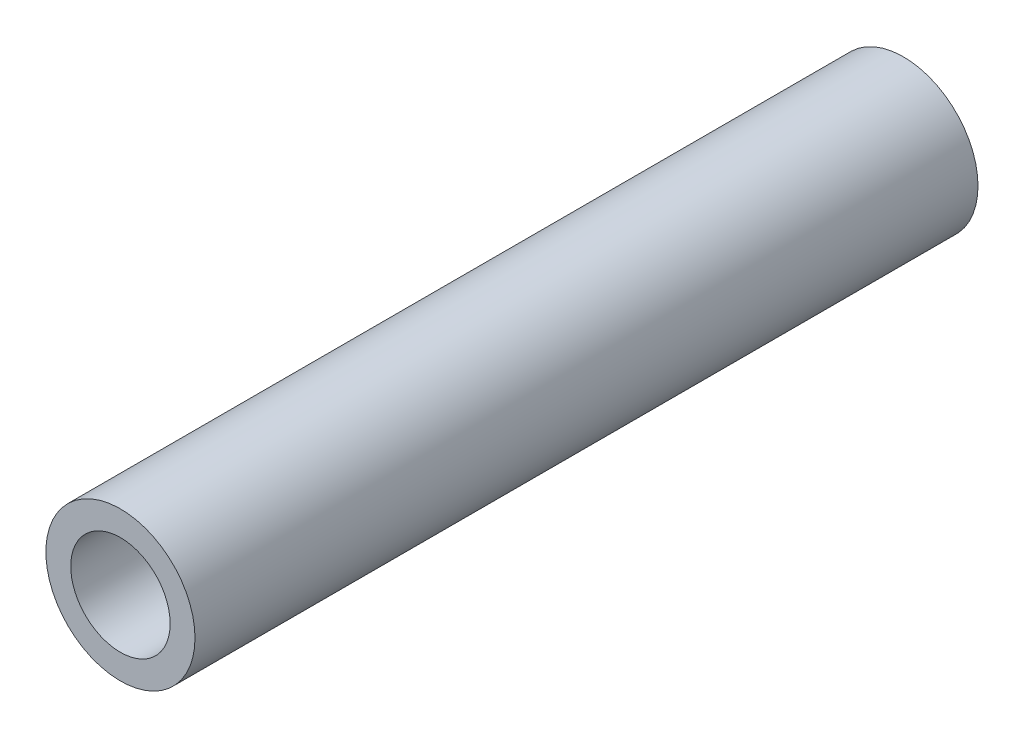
ISO-10303-21;
HEADER;
FILE_DESCRIPTION(('STEP AP214'),'2;1');
FILE_NAME('part.step','',(''),(''),'','','');
FILE_SCHEMA(('AUTOMOTIVE_DESIGN { 1 0 10303 214 1 1 1 1 }'));
ENDSEC;
DATA;
#1=APPLICATION_CONTEXT('core data for automotive mechanical design processes');
#2=APPLICATION_PROTOCOL_DEFINITION('international standard','automotive_design',2000,#1);
#3=PRODUCT_CONTEXT('',#1,'mechanical');
#4=PRODUCT('Part','Part','',(#3));
#5=PRODUCT_RELATED_PRODUCT_CATEGORY('part','',(#4));
#6=PRODUCT_DEFINITION_FORMATION('','',#4);
#7=PRODUCT_DEFINITION_CONTEXT('part definition',#1,'design');
#8=PRODUCT_DEFINITION('design','',#6,#7);
#9=PRODUCT_DEFINITION_SHAPE('','',#8);
#10=(LENGTH_UNIT() NAMED_UNIT(*) SI_UNIT(.MILLI.,.METRE.));
#11=(NAMED_UNIT(*) PLANE_ANGLE_UNIT() SI_UNIT($,.RADIAN.));
#12=(NAMED_UNIT(*) SI_UNIT($,.STERADIAN.) SOLID_ANGLE_UNIT());
#13=UNCERTAINTY_MEASURE_WITH_UNIT(LENGTH_MEASURE(1.E-05),#10,'distance_accuracy_value','');
#14=(GEOMETRIC_REPRESENTATION_CONTEXT(3) GLOBAL_UNCERTAINTY_ASSIGNED_CONTEXT((#13)) GLOBAL_UNIT_ASSIGNED_CONTEXT((#10,
#11,#12)) REPRESENTATION_CONTEXT('',''));
#15=CARTESIAN_POINT('',(0.,0.,0.));
#16=DIRECTION('',(0.,0.,1.));
#17=DIRECTION('',(1.,0.,0.));
#18=AXIS2_PLACEMENT_3D('',#15,#16,#17);
#19=CARTESIAN_POINT('',(0.,0.,31.5));
#20=DIRECTION('',(0.,0.,1.));
#21=DIRECTION('',(1.,0.,0.));
#22=AXIS2_PLACEMENT_3D('',#19,#20,#21);
#23=PLANE('',#22);
#24=CARTESIAN_POINT('',(0.,0.,31.5));
#25=DIRECTION('',(0.,0.,1.));
#26=DIRECTION('',(1.,0.,0.));
#27=AXIS2_PLACEMENT_3D('',#24,#25,#26);
#28=CIRCLE('',#27,3.);
#29=CARTESIAN_POINT('',(3.,0.,31.5));
#30=VERTEX_POINT('',#29);
#31=EDGE_CURVE('E10',#30,#30,#28,.T.);
#32=ORIENTED_EDGE('',*,*,#31,.T.);
#33=EDGE_LOOP('',(#32));
#34=FACE_BOUND('',#33,.T.);
#35=CARTESIAN_POINT('',(0.,0.,31.5));
#36=DIRECTION('',(0.,0.,1.));
#37=DIRECTION('',(1.,0.,0.));
#38=AXIS2_PLACEMENT_3D('',#35,#36,#37);
#39=CIRCLE('',#38,2.);
#40=CARTESIAN_POINT('',(2.,0.,31.5));
#41=VERTEX_POINT('',#40);
#42=EDGE_CURVE('E48',#41,#41,#39,.T.);
#43=ORIENTED_EDGE('',*,*,#42,.F.);
#44=EDGE_LOOP('',(#43));
#45=FACE_BOUND('',#44,.T.);
#46=ADVANCED_FACE('F37',(#34,#45),#23,.T.);
#47=CARTESIAN_POINT('',(0.,0.,0.));
#48=DIRECTION('',(0.,0.,1.));
#49=DIRECTION('',(1.,0.,0.));
#50=AXIS2_PLACEMENT_3D('',#47,#48,#49);
#51=PLANE('',#50);
#52=CARTESIAN_POINT('',(0.,0.,0.));
#53=DIRECTION('',(0.,0.,1.));
#54=DIRECTION('',(1.,0.,0.));
#55=AXIS2_PLACEMENT_3D('',#52,#53,#54);
#56=CIRCLE('',#55,3.);
#57=CARTESIAN_POINT('',(3.,0.,0.));
#58=VERTEX_POINT('',#57);
#59=EDGE_CURVE('E41',#58,#58,#56,.T.);
#60=ORIENTED_EDGE('',*,*,#59,.F.);
#61=EDGE_LOOP('',(#60));
#62=FACE_BOUND('',#61,.T.);
#63=CARTESIAN_POINT('',(0.,0.,0.));
#64=DIRECTION('',(0.,0.,1.));
#65=DIRECTION('',(1.,0.,0.));
#66=AXIS2_PLACEMENT_3D('',#63,#64,#65);
#67=CIRCLE('',#66,2.);
#68=CARTESIAN_POINT('',(2.,0.,0.));
#69=VERTEX_POINT('',#68);
#70=EDGE_CURVE('E50',#69,#69,#67,.T.);
#71=ORIENTED_EDGE('',*,*,#70,.T.);
#72=EDGE_LOOP('',(#71));
#73=FACE_BOUND('',#72,.T.);
#74=ADVANCED_FACE('F60',(#62,#73),#51,.F.);
#75=CARTESIAN_POINT('',(0.,0.,31.5));
#76=DIRECTION('',(0.,0.,-1.));
#77=DIRECTION('',(-1.,0.,0.));
#78=AXIS2_PLACEMENT_3D('',#75,#76,#77);
#79=CYLINDRICAL_SURFACE('',#78,3.);
#80=ORIENTED_EDGE('',*,*,#31,.F.);
#81=EDGE_LOOP('',(#80));
#82=FACE_BOUND('',#81,.T.);
#83=ORIENTED_EDGE('',*,*,#59,.T.);
#84=EDGE_LOOP('',(#83));
#85=FACE_BOUND('',#84,.T.);
#86=ADVANCED_FACE('F39',(#82,#85),#79,.T.);
#87=CARTESIAN_POINT('',(0.,0.,31.5));
#88=DIRECTION('',(0.,0.,-1.));
#89=DIRECTION('',(-1.,0.,0.));
#90=AXIS2_PLACEMENT_3D('',#87,#88,#89);
#91=CYLINDRICAL_SURFACE('',#90,2.);
#92=ORIENTED_EDGE('',*,*,#42,.T.);
#93=EDGE_LOOP('',(#92));
#94=FACE_BOUND('',#93,.T.);
#95=ORIENTED_EDGE('',*,*,#70,.F.);
#96=EDGE_LOOP('',(#95));
#97=FACE_BOUND('',#96,.T.);
#98=ADVANCED_FACE('F56',(#94,#97),#91,.F.);
#99=CLOSED_SHELL('',(#46,#74,#86,#98));
#100=MANIFOLD_SOLID_BREP('B2',#99);
#101=ADVANCED_BREP_SHAPE_REPRESENTATION('',(#18,#100),#14);
#102=SHAPE_DEFINITION_REPRESENTATION(#9,#101);
ENDSEC;
END-ISO-10303-21;
